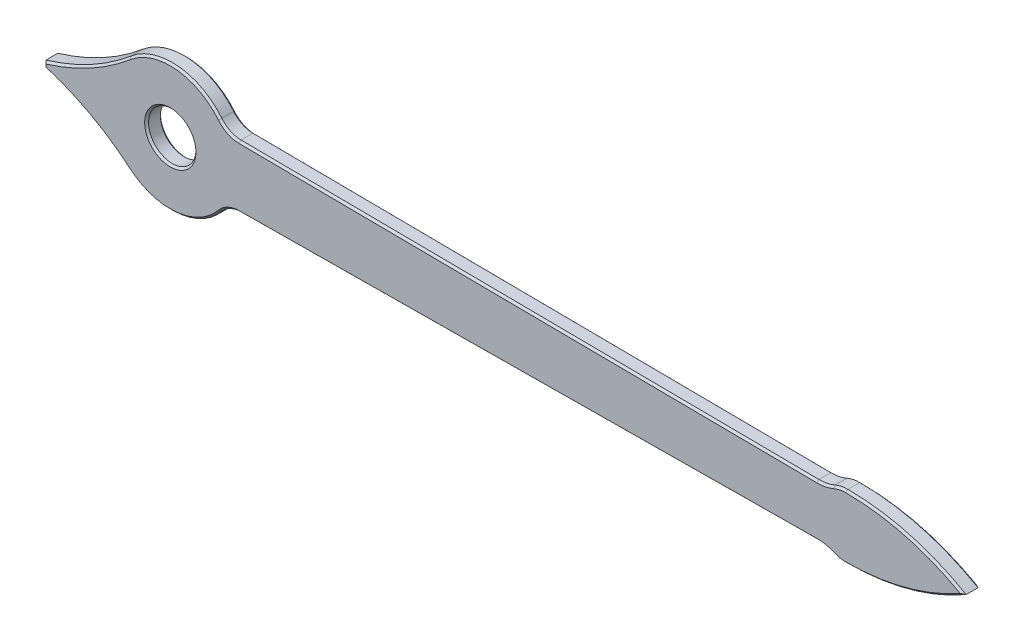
ISO-10303-21;
HEADER;
FILE_DESCRIPTION(('STEP AP214'),'2;1');
FILE_NAME('part.step','',(''),(''),'','','');
FILE_SCHEMA(('AUTOMOTIVE_DESIGN { 1 0 10303 214 1 1 1 1 }'));
ENDSEC;
DATA;
#1=APPLICATION_CONTEXT('core data for automotive mechanical design processes');
#2=APPLICATION_PROTOCOL_DEFINITION('international standard','automotive_design',2000,#1);
#3=PRODUCT_CONTEXT('',#1,'mechanical');
#4=PRODUCT('Part','Part','',(#3));
#5=PRODUCT_RELATED_PRODUCT_CATEGORY('part','',(#4));
#6=PRODUCT_DEFINITION_FORMATION('','',#4);
#7=PRODUCT_DEFINITION_CONTEXT('part definition',#1,'design');
#8=PRODUCT_DEFINITION('design','',#6,#7);
#9=PRODUCT_DEFINITION_SHAPE('','',#8);
#10=(LENGTH_UNIT() NAMED_UNIT(*) SI_UNIT(.MILLI.,.METRE.));
#11=(NAMED_UNIT(*) PLANE_ANGLE_UNIT() SI_UNIT($,.RADIAN.));
#12=(NAMED_UNIT(*) SI_UNIT($,.STERADIAN.) SOLID_ANGLE_UNIT());
#13=UNCERTAINTY_MEASURE_WITH_UNIT(LENGTH_MEASURE(1.E-05),#10,'distance_accuracy_value','');
#14=(GEOMETRIC_REPRESENTATION_CONTEXT(3) GLOBAL_UNCERTAINTY_ASSIGNED_CONTEXT((#13)) GLOBAL_UNIT_ASSIGNED_CONTEXT((#10,
#11,#12)) REPRESENTATION_CONTEXT('',''));
#15=CARTESIAN_POINT('',(0.,0.,0.));
#16=DIRECTION('',(0.,0.,1.));
#17=DIRECTION('',(1.,0.,0.));
#18=AXIS2_PLACEMENT_3D('',#15,#16,#17);
#19=CARTESIAN_POINT('',(85.6,25.7527777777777,2.));
#20=DIRECTION('',(0.,0.,-1.));
#21=DIRECTION('',(-1.,0.,0.));
#22=AXIS2_PLACEMENT_3D('',#19,#20,#21);
#23=PLANE('',#22);
#24=CARTESIAN_POINT('',(0.,0.,2.));
#25=DIRECTION('',(0.,0.,-1.));
#26=DIRECTION('',(-1.,0.,0.));
#27=AXIS2_PLACEMENT_3D('',#24,#25,#26);
#28=CIRCLE('',#27,3.24999999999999);
#29=CARTESIAN_POINT('',(-3.24999999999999,0.,2.));
#30=VERTEX_POINT('',#29);
#31=EDGE_CURVE('E11',#30,#30,#28,.T.);
#32=ORIENTED_EDGE('',*,*,#31,.T.);
#33=EDGE_LOOP('',(#32));
#34=FACE_BOUND('',#33,.T.);
#35=CARTESIAN_POINT('',(81.9922776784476,-8.29980961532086,2.));
#36=DIRECTION('',(0.,0.,-1.));
#37=DIRECTION('',(-1.,0.,0.));
#38=AXIS2_PLACEMENT_3D('',#35,#36,#37);
#39=CIRCLE('',#38,5.25000000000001);
#40=CARTESIAN_POINT('',(81.9464633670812,-3.05000951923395,2.));
#41=VERTEX_POINT('',#40);
#42=CARTESIAN_POINT('',(84.0851552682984,-3.4850029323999,2.));
#43=VERTEX_POINT('',#42);
#44=EDGE_CURVE('E48',#41,#43,#39,.T.);
#45=ORIENTED_EDGE('',*,*,#44,.T.);
#46=CARTESIAN_POINT('',(85.6,0.,2.));
#47=DIRECTION('',(0.,0.,-1.));
#48=DIRECTION('',(-1.,0.,0.));
#49=AXIS2_PLACEMENT_3D('',#46,#47,#48);
#50=CIRCLE('',#49,3.79999999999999);
#51=CARTESIAN_POINT('',(85.6,-3.79999999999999,2.));
#52=VERTEX_POINT('',#51);
#53=EDGE_CURVE('E40',#43,#52,#50,.F.);
#54=ORIENTED_EDGE('',*,*,#53,.T.);
#55=CARTESIAN_POINT('',(85.6,25.7527777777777,2.));
#56=DIRECTION('',(0.,0.,-1.));
#57=DIRECTION('',(-1.,0.,0.));
#58=AXIS2_PLACEMENT_3D('',#55,#56,#57);
#59=CIRCLE('',#58,29.5527777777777);
#60=CARTESIAN_POINT('',(100.096934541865,0.,2.));
#61=VERTEX_POINT('',#60);
#62=EDGE_CURVE('E331',#52,#61,#59,.F.);
#63=ORIENTED_EDGE('',*,*,#62,.T.);
#64=CARTESIAN_POINT('',(85.6,-25.7527777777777,2.));
#65=DIRECTION('',(0.,0.,-1.));
#66=DIRECTION('',(-1.,0.,0.));
#67=AXIS2_PLACEMENT_3D('',#64,#65,#66);
#68=CIRCLE('',#67,29.5527777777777);
#69=CARTESIAN_POINT('',(85.6,3.79999999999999,2.));
#70=VERTEX_POINT('',#69);
#71=EDGE_CURVE('E333',#61,#70,#68,.F.);
#72=ORIENTED_EDGE('',*,*,#71,.T.);
#73=CARTESIAN_POINT('',(85.6,0.,2.));
#74=DIRECTION('',(0.,0.,-1.));
#75=DIRECTION('',(-1.,0.,0.));
#76=AXIS2_PLACEMENT_3D('',#73,#74,#75);
#77=CIRCLE('',#76,3.79999999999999);
#78=CARTESIAN_POINT('',(84.0851552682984,3.4850029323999,2.));
#79=VERTEX_POINT('',#78);
#80=EDGE_CURVE('E335',#70,#79,#77,.F.);
#81=ORIENTED_EDGE('',*,*,#80,.T.);
#82=CARTESIAN_POINT('',(81.9922776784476,8.29980961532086,2.));
#83=DIRECTION('',(0.,0.,-1.));
#84=DIRECTION('',(-1.,0.,0.));
#85=AXIS2_PLACEMENT_3D('',#82,#83,#84);
#86=CIRCLE('',#85,5.25000000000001);
#87=CARTESIAN_POINT('',(81.9464633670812,3.05000951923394,2.));
#88=VERTEX_POINT('',#87);
#89=EDGE_CURVE('E337',#79,#88,#86,.T.);
#90=ORIENTED_EDGE('',*,*,#89,.T.);
#91=DIRECTION('',(-0.999961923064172,0.00872653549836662,0.));
#92=VECTOR('',#91,1.);
#93=CARTESIAN_POINT('',(85.4016128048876,3.01985688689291,2.));
#94=LINE('',#93,#92);
#95=CARTESIAN_POINT('',(8.71754025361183,3.68906864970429,2.));
#96=VERTEX_POINT('',#95);
#97=EDGE_CURVE('E339',#88,#96,#94,.T.);
#98=ORIENTED_EDGE('',*,*,#97,.T.);
#99=CARTESIAN_POINT('',(8.74742863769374,7.11393823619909,2.));
#100=DIRECTION('',(0.,0.,-1.));
#101=DIRECTION('',(-1.,0.,0.));
#102=AXIS2_PLACEMENT_3D('',#99,#100,#101);
#103=CIRCLE('',#102,3.42500000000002);
#104=CARTESIAN_POINT('',(6.09022747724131,4.95294147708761,2.));
#105=VERTEX_POINT('',#104);
#106=EDGE_CURVE('E341',#96,#105,#103,.T.);
#107=ORIENTED_EDGE('',*,*,#106,.T.);
#108=CARTESIAN_POINT('',(0.,0.,2.));
#109=DIRECTION('',(0.,0.,-1.));
#110=DIRECTION('',(-1.,0.,0.));
#111=AXIS2_PLACEMENT_3D('',#108,#109,#110);
#112=CIRCLE('',#111,7.84999999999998);
#113=CARTESIAN_POINT('',(-5.06752410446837,5.99522305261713,2.));
#114=VERTEX_POINT('',#113);
#115=EDGE_CURVE('E343',#105,#114,#112,.F.);
#116=ORIENTED_EDGE('',*,*,#115,.T.);
#117=CARTESIAN_POINT('',(-24.5952443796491,29.0978341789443,2.));
#118=DIRECTION('',(0.,0.,-1.));
#119=DIRECTION('',(-1.,0.,0.));
#120=AXIS2_PLACEMENT_3D('',#117,#118,#119);
#121=CIRCLE('',#120,30.25);
#122=CARTESIAN_POINT('',(-15.75,0.1699211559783,2.));
#123=VERTEX_POINT('',#122);
#124=EDGE_CURVE('E345',#114,#123,#121,.T.);
#125=ORIENTED_EDGE('',*,*,#124,.T.);
#126=DIRECTION('',(0.,-1.,0.));
#127=VECTOR('',#126,1.);
#128=CARTESIAN_POINT('',(-15.75,25.7527777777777,2.));
#129=LINE('',#128,#127);
#130=CARTESIAN_POINT('',(-15.75,-0.1699211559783,2.));
#131=VERTEX_POINT('',#130);
#132=EDGE_CURVE('E347',#123,#131,#129,.T.);
#133=ORIENTED_EDGE('',*,*,#132,.T.);
#134=CARTESIAN_POINT('',(-24.5952443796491,-29.0978341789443,2.));
#135=DIRECTION('',(0.,0.,-1.));
#136=DIRECTION('',(-1.,0.,0.));
#137=AXIS2_PLACEMENT_3D('',#134,#135,#136);
#138=CIRCLE('',#137,30.25);
#139=CARTESIAN_POINT('',(-5.06752410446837,-5.99522305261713,2.));
#140=VERTEX_POINT('',#139);
#141=EDGE_CURVE('E349',#131,#140,#138,.T.);
#142=ORIENTED_EDGE('',*,*,#141,.T.);
#143=CARTESIAN_POINT('',(0.,0.,2.));
#144=DIRECTION('',(0.,0.,-1.));
#145=DIRECTION('',(-1.,0.,0.));
#146=AXIS2_PLACEMENT_3D('',#143,#144,#145);
#147=CIRCLE('',#146,7.84999999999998);
#148=CARTESIAN_POINT('',(6.0902274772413,-4.95294147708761,2.));
#149=VERTEX_POINT('',#148);
#150=EDGE_CURVE('E351',#140,#149,#147,.F.);
#151=ORIENTED_EDGE('',*,*,#150,.T.);
#152=CARTESIAN_POINT('',(8.74742863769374,-7.11393823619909,2.));
#153=DIRECTION('',(0.,0.,-1.));
#154=DIRECTION('',(-1.,0.,0.));
#155=AXIS2_PLACEMENT_3D('',#152,#153,#154);
#156=CIRCLE('',#155,3.42500000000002);
#157=CARTESIAN_POINT('',(8.71754025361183,-3.68906864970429,2.));
#158=VERTEX_POINT('',#157);
#159=EDGE_CURVE('E353',#149,#158,#156,.T.);
#160=ORIENTED_EDGE('',*,*,#159,.T.);
#161=DIRECTION('',(0.999961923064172,0.00872653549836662,0.));
#162=VECTOR('',#161,1.);
#163=CARTESIAN_POINT('',(85.8510607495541,-3.01593461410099,2.));
#164=LINE('',#163,#162);
#165=EDGE_CURVE('E53',#158,#41,#164,.T.);
#166=ORIENTED_EDGE('',*,*,#165,.T.);
#167=EDGE_LOOP('',(#45,#54,#63,#72,#81,#90,#98,#107,#116,#125,#133,#142,#151,#160,#166));
#168=FACE_BOUND('',#167,.T.);
#169=ADVANCED_FACE('F31',(#34,#168),#23,.F.);
#170=CARTESIAN_POINT('',(85.6,25.7527777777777,0.));
#171=DIRECTION('',(0.,0.,-1.));
#172=DIRECTION('',(-1.,0.,0.));
#173=AXIS2_PLACEMENT_3D('',#170,#171,#172);
#174=PLANE('',#173);
#175=CARTESIAN_POINT('',(0.,0.,0.));
#176=DIRECTION('',(0.,0.,-1.));
#177=DIRECTION('',(-1.,0.,0.));
#178=AXIS2_PLACEMENT_3D('',#175,#176,#177);
#179=CIRCLE('',#178,3.24999999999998);
#180=CARTESIAN_POINT('',(-3.24999999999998,0.,0.));
#181=VERTEX_POINT('',#180);
#182=EDGE_CURVE('E257',#181,#181,#179,.F.);
#183=ORIENTED_EDGE('',*,*,#182,.T.);
#184=EDGE_LOOP('',(#183));
#185=FACE_BOUND('',#184,.T.);
#186=CARTESIAN_POINT('',(85.6,0.,0.));
#187=DIRECTION('',(0.,0.,-1.));
#188=DIRECTION('',(-1.,0.,0.));
#189=AXIS2_PLACEMENT_3D('',#186,#187,#188);
#190=CIRCLE('',#189,3.8);
#191=CARTESIAN_POINT('',(84.0851552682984,3.48500293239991,0.));
#192=VERTEX_POINT('',#191);
#193=CARTESIAN_POINT('',(85.6,3.8,0.));
#194=VERTEX_POINT('',#193);
#195=EDGE_CURVE('E256',#192,#194,#190,.T.);
#196=ORIENTED_EDGE('',*,*,#195,.T.);
#197=CARTESIAN_POINT('',(85.6,-25.7527777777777,0.));
#198=DIRECTION('',(0.,0.,-1.));
#199=DIRECTION('',(-1.,0.,0.));
#200=AXIS2_PLACEMENT_3D('',#197,#198,#199);
#201=CIRCLE('',#200,29.5527777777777);
#202=CARTESIAN_POINT('',(100.096934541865,0.,0.));
#203=VERTEX_POINT('',#202);
#204=EDGE_CURVE('E235',#194,#203,#201,.T.);
#205=ORIENTED_EDGE('',*,*,#204,.T.);
#206=CARTESIAN_POINT('',(85.6,25.7527777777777,0.));
#207=DIRECTION('',(0.,0.,-1.));
#208=DIRECTION('',(-1.,0.,0.));
#209=AXIS2_PLACEMENT_3D('',#206,#207,#208);
#210=CIRCLE('',#209,29.5527777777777);
#211=CARTESIAN_POINT('',(85.6,-3.8,0.));
#212=VERTEX_POINT('',#211);
#213=EDGE_CURVE('E245',#203,#212,#210,.T.);
#214=ORIENTED_EDGE('',*,*,#213,.T.);
#215=CARTESIAN_POINT('',(85.6,0.,0.));
#216=DIRECTION('',(0.,0.,-1.));
#217=DIRECTION('',(-1.,0.,0.));
#218=AXIS2_PLACEMENT_3D('',#215,#216,#217);
#219=CIRCLE('',#218,3.8);
#220=CARTESIAN_POINT('',(84.0851552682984,-3.48500293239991,0.));
#221=VERTEX_POINT('',#220);
#222=EDGE_CURVE('E251',#212,#221,#219,.T.);
#223=ORIENTED_EDGE('',*,*,#222,.T.);
#224=CARTESIAN_POINT('',(81.9922776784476,-8.29980961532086,0.));
#225=DIRECTION('',(0.,0.,-1.));
#226=DIRECTION('',(-1.,0.,0.));
#227=AXIS2_PLACEMENT_3D('',#224,#225,#226);
#228=CIRCLE('',#227,5.25);
#229=CARTESIAN_POINT('',(81.9464633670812,-3.05000951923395,0.));
#230=VERTEX_POINT('',#229);
#231=EDGE_CURVE('E619',#221,#230,#228,.F.);
#232=ORIENTED_EDGE('',*,*,#231,.T.);
#233=DIRECTION('',(-0.999961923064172,-0.00872653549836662,0.));
#234=VECTOR('',#233,1.);
#235=CARTESIAN_POINT('',(8.71754025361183,-3.6890686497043,0.));
#236=LINE('',#235,#234);
#237=CARTESIAN_POINT('',(8.71754025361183,-3.6890686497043,0.));
#238=VERTEX_POINT('',#237);
#239=EDGE_CURVE('E621',#230,#238,#236,.T.);
#240=ORIENTED_EDGE('',*,*,#239,.T.);
#241=CARTESIAN_POINT('',(8.74742863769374,-7.11393823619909,0.));
#242=DIRECTION('',(0.,0.,-1.));
#243=DIRECTION('',(-1.,0.,0.));
#244=AXIS2_PLACEMENT_3D('',#241,#242,#243);
#245=CIRCLE('',#244,3.42500000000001);
#246=CARTESIAN_POINT('',(6.09022747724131,-4.95294147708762,0.));
#247=VERTEX_POINT('',#246);
#248=EDGE_CURVE('E623',#238,#247,#245,.F.);
#249=ORIENTED_EDGE('',*,*,#248,.T.);
#250=CARTESIAN_POINT('',(0.,0.,0.));
#251=DIRECTION('',(0.,0.,-1.));
#252=DIRECTION('',(-1.,0.,0.));
#253=AXIS2_PLACEMENT_3D('',#250,#251,#252);
#254=CIRCLE('',#253,7.84999999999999);
#255=CARTESIAN_POINT('',(-5.06752410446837,-5.99522305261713,0.));
#256=VERTEX_POINT('',#255);
#257=EDGE_CURVE('E625',#247,#256,#254,.T.);
#258=ORIENTED_EDGE('',*,*,#257,.T.);
#259=CARTESIAN_POINT('',(-24.5952443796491,-29.0978341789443,0.));
#260=DIRECTION('',(0.,0.,-1.));
#261=DIRECTION('',(-1.,0.,0.));
#262=AXIS2_PLACEMENT_3D('',#259,#260,#261);
#263=CIRCLE('',#262,30.25);
#264=CARTESIAN_POINT('',(-15.75,-0.169921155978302,0.));
#265=VERTEX_POINT('',#264);
#266=EDGE_CURVE('E627',#256,#265,#263,.F.);
#267=ORIENTED_EDGE('',*,*,#266,.T.);
#268=DIRECTION('',(0.,1.,0.));
#269=VECTOR('',#268,1.);
#270=CARTESIAN_POINT('',(-15.75,0.355499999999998,0.));
#271=LINE('',#270,#269);
#272=CARTESIAN_POINT('',(-15.75,0.169921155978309,0.));
#273=VERTEX_POINT('',#272);
#274=EDGE_CURVE('E629',#265,#273,#271,.T.);
#275=ORIENTED_EDGE('',*,*,#274,.T.);
#276=CARTESIAN_POINT('',(-24.5952443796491,29.0978341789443,0.));
#277=DIRECTION('',(0.,0.,-1.));
#278=DIRECTION('',(-1.,0.,0.));
#279=AXIS2_PLACEMENT_3D('',#276,#277,#278);
#280=CIRCLE('',#279,30.25);
#281=CARTESIAN_POINT('',(-5.06752410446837,5.99522305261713,0.));
#282=VERTEX_POINT('',#281);
#283=EDGE_CURVE('E631',#273,#282,#280,.F.);
#284=ORIENTED_EDGE('',*,*,#283,.T.);
#285=CARTESIAN_POINT('',(0.,0.,0.));
#286=DIRECTION('',(0.,0.,-1.));
#287=DIRECTION('',(-1.,0.,0.));
#288=AXIS2_PLACEMENT_3D('',#285,#286,#287);
#289=CIRCLE('',#288,7.84999999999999);
#290=CARTESIAN_POINT('',(6.09022747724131,4.95294147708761,0.));
#291=VERTEX_POINT('',#290);
#292=EDGE_CURVE('E633',#282,#291,#289,.T.);
#293=ORIENTED_EDGE('',*,*,#292,.T.);
#294=CARTESIAN_POINT('',(8.74742863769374,7.11393823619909,0.));
#295=DIRECTION('',(0.,0.,-1.));
#296=DIRECTION('',(-1.,0.,0.));
#297=AXIS2_PLACEMENT_3D('',#294,#295,#296);
#298=CIRCLE('',#297,3.42500000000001);
#299=CARTESIAN_POINT('',(8.71754025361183,3.6890686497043,0.));
#300=VERTEX_POINT('',#299);
#301=EDGE_CURVE('E635',#291,#300,#298,.F.);
#302=ORIENTED_EDGE('',*,*,#301,.T.);
#303=DIRECTION('',(0.999961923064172,-0.00872653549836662,0.));
#304=VECTOR('',#303,1.);
#305=CARTESIAN_POINT('',(81.9464633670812,3.05000951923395,0.));
#306=LINE('',#305,#304);
#307=CARTESIAN_POINT('',(81.9464633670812,3.05000951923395,0.));
#308=VERTEX_POINT('',#307);
#309=EDGE_CURVE('E637',#300,#308,#306,.T.);
#310=ORIENTED_EDGE('',*,*,#309,.T.);
#311=CARTESIAN_POINT('',(81.9922776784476,8.29980961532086,0.));
#312=DIRECTION('',(0.,0.,-1.));
#313=DIRECTION('',(-1.,0.,0.));
#314=AXIS2_PLACEMENT_3D('',#311,#312,#313);
#315=CIRCLE('',#314,5.25);
#316=EDGE_CURVE('E262',#308,#192,#315,.F.);
#317=ORIENTED_EDGE('',*,*,#316,.T.);
#318=EDGE_LOOP('',(#196,#205,#214,#223,#232,#240,#249,#258,#267,#275,#284,#293,#302,#310,#317));
#319=FACE_BOUND('',#318,.T.);
#320=ADVANCED_FACE('F254',(#185,#319),#174,.T.);
#321=CARTESIAN_POINT('',(85.6,25.7527777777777,2.));
#322=DIRECTION('',(0.,0.,-1.));
#323=DIRECTION('',(-1.,0.,0.));
#324=AXIS2_PLACEMENT_3D('',#321,#322,#323);
#325=CYLINDRICAL_SURFACE('',#324,29.8027777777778);
#326=DIRECTION('',(0.,0.,-1.));
#327=VECTOR('',#326,1.);
#328=CARTESIAN_POINT('',(85.6,-4.05,2.));
#329=LINE('',#328,#327);
#330=CARTESIAN_POINT('',(85.6,-4.05,1.74999999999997));
#331=VERTEX_POINT('',#330);
#332=CARTESIAN_POINT('',(85.6,-4.05,0.250000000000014));
#333=VERTEX_POINT('',#332);
#334=EDGE_CURVE('E433',#331,#333,#329,.T.);
#335=ORIENTED_EDGE('',*,*,#334,.T.);
#336=CARTESIAN_POINT('',(85.6,25.7527777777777,0.250000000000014));
#337=DIRECTION('',(0.,0.,-1.));
#338=DIRECTION('',(-1.,0.,0.));
#339=AXIS2_PLACEMENT_3D('',#336,#337,#338);
#340=CIRCLE('',#339,29.8027777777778);
#341=CARTESIAN_POINT('',(100.6,0.,0.250000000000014));
#342=VERTEX_POINT('',#341);
#343=EDGE_CURVE('E329',#333,#342,#340,.F.);
#344=ORIENTED_EDGE('',*,*,#343,.T.);
#345=DIRECTION('',(0.,0.,-1.));
#346=VECTOR('',#345,1.);
#347=CARTESIAN_POINT('',(100.6,0.,2.));
#348=LINE('',#347,#346);
#349=CARTESIAN_POINT('',(100.6,0.,1.74999999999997));
#350=VERTEX_POINT('',#349);
#351=EDGE_CURVE('E252',#350,#342,#348,.T.);
#352=ORIENTED_EDGE('',*,*,#351,.F.);
#353=CARTESIAN_POINT('',(85.6,25.7527777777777,1.74999999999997));
#354=DIRECTION('',(0.,0.,-1.));
#355=DIRECTION('',(-1.,0.,0.));
#356=AXIS2_PLACEMENT_3D('',#353,#354,#355);
#357=CIRCLE('',#356,29.8027777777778);
#358=EDGE_CURVE('E327',#350,#331,#357,.T.);
#359=ORIENTED_EDGE('',*,*,#358,.T.);
#360=EDGE_LOOP('',(#335,#344,#352,#359));
#361=FACE_BOUND('',#360,.T.);
#362=ADVANCED_FACE('F570',(#361),#325,.T.);
#363=CARTESIAN_POINT('',(85.6,-25.7527777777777,2.));
#364=DIRECTION('',(0.,0.,-1.));
#365=DIRECTION('',(-1.,0.,0.));
#366=AXIS2_PLACEMENT_3D('',#363,#364,#365);
#367=CYLINDRICAL_SURFACE('',#366,29.8027777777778);
#368=ORIENTED_EDGE('',*,*,#351,.T.);
#369=CARTESIAN_POINT('',(85.6,-25.7527777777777,0.250000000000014));
#370=DIRECTION('',(0.,0.,-1.));
#371=DIRECTION('',(-1.,0.,0.));
#372=AXIS2_PLACEMENT_3D('',#369,#370,#371);
#373=CIRCLE('',#372,29.8027777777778);
#374=CARTESIAN_POINT('',(85.6,4.05000000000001,0.250000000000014));
#375=VERTEX_POINT('',#374);
#376=EDGE_CURVE('E238',#342,#375,#373,.F.);
#377=ORIENTED_EDGE('',*,*,#376,.T.);
#378=DIRECTION('',(0.,0.,-1.));
#379=VECTOR('',#378,1.);
#380=CARTESIAN_POINT('',(85.6,4.05000000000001,2.));
#381=LINE('',#380,#379);
#382=CARTESIAN_POINT('',(85.6,4.05000000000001,1.74999999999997));
#383=VERTEX_POINT('',#382);
#384=EDGE_CURVE('E614',#383,#375,#381,.T.);
#385=ORIENTED_EDGE('',*,*,#384,.F.);
#386=CARTESIAN_POINT('',(85.6,-25.7527777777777,1.74999999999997));
#387=DIRECTION('',(0.,0.,-1.));
#388=DIRECTION('',(-1.,0.,0.));
#389=AXIS2_PLACEMENT_3D('',#386,#387,#388);
#390=CIRCLE('',#389,29.8027777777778);
#391=EDGE_CURVE('E271',#383,#350,#390,.T.);
#392=ORIENTED_EDGE('',*,*,#391,.T.);
#393=EDGE_LOOP('',(#368,#377,#385,#392));
#394=FACE_BOUND('',#393,.T.);
#395=ADVANCED_FACE('F650',(#394),#367,.T.);
#396=CARTESIAN_POINT('',(85.6,0.,2.));
#397=DIRECTION('',(0.,0.,-1.));
#398=DIRECTION('',(-1.,0.,0.));
#399=AXIS2_PLACEMENT_3D('',#396,#397,#398);
#400=CYLINDRICAL_SURFACE('',#399,4.05);
#401=ORIENTED_EDGE('',*,*,#384,.T.);
#402=CARTESIAN_POINT('',(85.6,0.,0.250000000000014));
#403=DIRECTION('',(0.,0.,-1.));
#404=DIRECTION('',(-1.,0.,0.));
#405=AXIS2_PLACEMENT_3D('',#402,#403,#404);
#406=CIRCLE('',#405,4.05);
#407=CARTESIAN_POINT('',(83.9854944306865,3.71427944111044,0.250000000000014));
#408=VERTEX_POINT('',#407);
#409=EDGE_CURVE('E276',#375,#408,#406,.F.);
#410=ORIENTED_EDGE('',*,*,#409,.T.);
#411=DIRECTION('',(0.,0.,-1.));
#412=VECTOR('',#411,1.);
#413=CARTESIAN_POINT('',(83.9854944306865,3.71427944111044,2.));
#414=LINE('',#413,#412);
#415=CARTESIAN_POINT('',(83.9854944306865,3.71427944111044,1.74999999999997));
#416=VERTEX_POINT('',#415);
#417=EDGE_CURVE('E611',#416,#408,#414,.T.);
#418=ORIENTED_EDGE('',*,*,#417,.F.);
#419=CARTESIAN_POINT('',(85.6,0.,1.74999999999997));
#420=DIRECTION('',(0.,0.,-1.));
#421=DIRECTION('',(-1.,0.,0.));
#422=AXIS2_PLACEMENT_3D('',#419,#420,#421);
#423=CIRCLE('',#422,4.05);
#424=EDGE_CURVE('E274',#416,#383,#423,.T.);
#425=ORIENTED_EDGE('',*,*,#424,.T.);
#426=EDGE_LOOP('',(#401,#410,#418,#425));
#427=FACE_BOUND('',#426,.T.);
#428=ADVANCED_FACE('F651',(#427),#400,.T.);
#429=CARTESIAN_POINT('',(81.9922776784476,8.29980961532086,2.));
#430=DIRECTION('',(0.,0.,-1.));
#431=DIRECTION('',(-1.,0.,0.));
#432=AXIS2_PLACEMENT_3D('',#429,#430,#431);
#433=CYLINDRICAL_SURFACE('',#432,5.);
#434=ORIENTED_EDGE('',*,*,#417,.T.);
#435=CARTESIAN_POINT('',(81.9922776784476,8.29980961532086,0.250000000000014));
#436=DIRECTION('',(0.,0.,-1.));
#437=DIRECTION('',(-1.,0.,0.));
#438=AXIS2_PLACEMENT_3D('',#435,#436,#437);
#439=CIRCLE('',#438,5.);
#440=CARTESIAN_POINT('',(81.9486450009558,3.3,0.250000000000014));
#441=VERTEX_POINT('',#440);
#442=EDGE_CURVE('E280',#408,#441,#439,.T.);
#443=ORIENTED_EDGE('',*,*,#442,.T.);
#444=DIRECTION('',(0.,0.,-1.));
#445=VECTOR('',#444,1.);
#446=CARTESIAN_POINT('',(81.9486450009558,3.3,2.));
#447=LINE('',#446,#445);
#448=CARTESIAN_POINT('',(81.9486450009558,3.3,1.74999999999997));
#449=VERTEX_POINT('',#448);
#450=EDGE_CURVE('E608',#449,#441,#447,.T.);
#451=ORIENTED_EDGE('',*,*,#450,.F.);
#452=CARTESIAN_POINT('',(81.9922776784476,8.29980961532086,1.74999999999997));
#453=DIRECTION('',(0.,0.,-1.));
#454=DIRECTION('',(-1.,0.,0.));
#455=AXIS2_PLACEMENT_3D('',#452,#453,#454);
#456=CIRCLE('',#455,5.);
#457=EDGE_CURVE('E278',#449,#416,#456,.F.);
#458=ORIENTED_EDGE('',*,*,#457,.T.);
#459=EDGE_LOOP('',(#434,#443,#451,#458));
#460=FACE_BOUND('',#459,.T.);
#461=ADVANCED_FACE('F670',(#460),#433,.F.);
#462=CARTESIAN_POINT('',(81.9486450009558,3.3,2.));
#463=DIRECTION('',(-0.00872653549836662,-0.999961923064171,0.));
#464=DIRECTION('',(0.999961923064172,-0.00872653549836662,0.));
#465=AXIS2_PLACEMENT_3D('',#462,#463,#464);
#466=PLANE('',#465);
#467=ORIENTED_EDGE('',*,*,#450,.T.);
#468=DIRECTION('',(-0.999961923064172,0.00872653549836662,0.));
#469=VECTOR('',#468,1.);
#470=CARTESIAN_POINT('',(8.71972188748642,3.93905913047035,0.250000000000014));
#471=LINE('',#470,#469);
#472=CARTESIAN_POINT('',(8.71972188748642,3.93905913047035,0.250000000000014));
#473=VERTEX_POINT('',#472);
#474=EDGE_CURVE('E284',#441,#473,#471,.T.);
#475=ORIENTED_EDGE('',*,*,#474,.T.);
#476=DIRECTION('',(0.,0.,-1.));
#477=VECTOR('',#476,1.);
#478=CARTESIAN_POINT('',(8.71972188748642,3.93905913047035,2.));
#479=LINE('',#478,#477);
#480=CARTESIAN_POINT('',(8.71972188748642,3.93905913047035,1.74999999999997));
#481=VERTEX_POINT('',#480);
#482=EDGE_CURVE('E605',#481,#473,#479,.T.);
#483=ORIENTED_EDGE('',*,*,#482,.F.);
#484=DIRECTION('',(0.999961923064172,-0.00872653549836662,0.));
#485=VECTOR('',#484,1.);
#486=CARTESIAN_POINT('',(81.9486450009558,3.3,1.74999999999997));
#487=LINE('',#486,#485);
#488=EDGE_CURVE('E282',#481,#449,#487,.T.);
#489=ORIENTED_EDGE('',*,*,#488,.T.);
#490=EDGE_LOOP('',(#467,#475,#483,#489));
#491=FACE_BOUND('',#490,.T.);
#492=ADVANCED_FACE('F667',(#491),#466,.F.);
#493=CARTESIAN_POINT('',(8.74742863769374,7.11393823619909,2.));
#494=DIRECTION('',(0.,0.,-1.));
#495=DIRECTION('',(-1.,0.,0.));
#496=AXIS2_PLACEMENT_3D('',#493,#494,#495);
#497=CYLINDRICAL_SURFACE('',#496,3.175);
#498=ORIENTED_EDGE('',*,*,#482,.T.);
#499=CARTESIAN_POINT('',(8.74742863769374,7.11393823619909,0.250000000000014));
#500=DIRECTION('',(0.,0.,-1.));
#501=DIRECTION('',(-1.,0.,0.));
#502=AXIS2_PLACEMENT_3D('',#499,#500,#501);
#503=CIRCLE('',#502,3.175);
#504=CARTESIAN_POINT('',(6.28418376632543,5.11067846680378,0.250000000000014));
#505=VERTEX_POINT('',#504);
#506=EDGE_CURVE('E288',#473,#505,#503,.T.);
#507=ORIENTED_EDGE('',*,*,#506,.T.);
#508=DIRECTION('',(0.,0.,-1.));
#509=VECTOR('',#508,1.);
#510=CARTESIAN_POINT('',(6.28418376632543,5.11067846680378,2.));
#511=LINE('',#510,#509);
#512=CARTESIAN_POINT('',(6.28418376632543,5.11067846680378,1.74999999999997));
#513=VERTEX_POINT('',#512);
#514=EDGE_CURVE('E602',#513,#505,#511,.T.);
#515=ORIENTED_EDGE('',*,*,#514,.F.);
#516=CARTESIAN_POINT('',(8.74742863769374,7.11393823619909,1.74999999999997));
#517=DIRECTION('',(0.,0.,-1.));
#518=DIRECTION('',(-1.,0.,0.));
#519=AXIS2_PLACEMENT_3D('',#516,#517,#518);
#520=CIRCLE('',#519,3.175);
#521=EDGE_CURVE('E286',#513,#481,#520,.F.);
#522=ORIENTED_EDGE('',*,*,#521,.T.);
#523=EDGE_LOOP('',(#498,#507,#515,#522));
#524=FACE_BOUND('',#523,.T.);
#525=ADVANCED_FACE('F677',(#524),#497,.F.);
#526=CARTESIAN_POINT('',(0.,0.,2.));
#527=DIRECTION('',(0.,0.,-1.));
#528=DIRECTION('',(-1.,0.,0.));
#529=AXIS2_PLACEMENT_3D('',#526,#527,#528);
#530=CYLINDRICAL_SURFACE('',#529,8.1);
#531=ORIENTED_EDGE('',*,*,#514,.T.);
#532=CARTESIAN_POINT('',(0.,0.,0.250000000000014));
#533=DIRECTION('',(0.,0.,-1.));
#534=DIRECTION('',(-1.,0.,0.));
#535=AXIS2_PLACEMENT_3D('',#532,#533,#534);
#536=CIRCLE('',#535,8.1);
#537=CARTESIAN_POINT('',(-5.22891022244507,6.18615372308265,0.250000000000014));
#538=VERTEX_POINT('',#537);
#539=EDGE_CURVE('E292',#505,#538,#536,.F.);
#540=ORIENTED_EDGE('',*,*,#539,.T.);
#541=DIRECTION('',(0.,0.,-1.));
#542=VECTOR('',#541,1.);
#543=CARTESIAN_POINT('',(-5.22891022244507,6.18615372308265,2.));
#544=LINE('',#543,#542);
#545=CARTESIAN_POINT('',(-5.22891022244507,6.18615372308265,1.74999999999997));
#546=VERTEX_POINT('',#545);
#547=EDGE_CURVE('E599',#546,#538,#544,.T.);
#548=ORIENTED_EDGE('',*,*,#547,.F.);
#549=CARTESIAN_POINT('',(0.,0.,1.74999999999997));
#550=DIRECTION('',(0.,0.,-1.));
#551=DIRECTION('',(-1.,0.,0.));
#552=AXIS2_PLACEMENT_3D('',#549,#550,#551);
#553=CIRCLE('',#552,8.1);
#554=EDGE_CURVE('E290',#546,#513,#553,.T.);
#555=ORIENTED_EDGE('',*,*,#554,.T.);
#556=EDGE_LOOP('',(#531,#540,#548,#555));
#557=FACE_BOUND('',#556,.T.);
#558=ADVANCED_FACE('F720',(#557),#530,.T.);
#559=CARTESIAN_POINT('',(-24.5952443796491,29.0978341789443,2.));
#560=DIRECTION('',(0.,0.,-1.));
#561=DIRECTION('',(-1.,0.,0.));
#562=AXIS2_PLACEMENT_3D('',#559,#560,#561);
#563=CYLINDRICAL_SURFACE('',#562,30.);
#564=ORIENTED_EDGE('',*,*,#547,.T.);
#565=CARTESIAN_POINT('',(-24.5952443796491,29.0978341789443,0.250000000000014));
#566=DIRECTION('',(0.,0.,-1.));
#567=DIRECTION('',(-1.,0.,0.));
#568=AXIS2_PLACEMENT_3D('',#565,#566,#567);
#569=CIRCLE('',#568,30.);
#570=CARTESIAN_POINT('',(-16.,0.355499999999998,0.250000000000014));
#571=VERTEX_POINT('',#570);
#572=EDGE_CURVE('E296',#538,#571,#569,.T.);
#573=ORIENTED_EDGE('',*,*,#572,.T.);
#574=DIRECTION('',(0.,0.,-1.));
#575=VECTOR('',#574,1.);
#576=CARTESIAN_POINT('',(-16.,0.355499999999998,2.));
#577=LINE('',#576,#575);
#578=CARTESIAN_POINT('',(-16.,0.355499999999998,1.74999999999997));
#579=VERTEX_POINT('',#578);
#580=EDGE_CURVE('E596',#579,#571,#577,.T.);
#581=ORIENTED_EDGE('',*,*,#580,.F.);
#582=CARTESIAN_POINT('',(-24.5952443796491,29.0978341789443,1.74999999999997));
#583=DIRECTION('',(0.,0.,-1.));
#584=DIRECTION('',(-1.,0.,0.));
#585=AXIS2_PLACEMENT_3D('',#582,#583,#584);
#586=CIRCLE('',#585,30.);
#587=EDGE_CURVE('E294',#579,#546,#586,.F.);
#588=ORIENTED_EDGE('',*,*,#587,.T.);
#589=EDGE_LOOP('',(#564,#573,#581,#588));
#590=FACE_BOUND('',#589,.T.);
#591=ADVANCED_FACE('F716',(#590),#563,.F.);
#592=CARTESIAN_POINT('',(-16.,0.3555,2.));
#593=DIRECTION('',(1.,0.,0.));
#594=DIRECTION('',(0.,0.,-1.));
#595=AXIS2_PLACEMENT_3D('',#592,#593,#594);
#596=PLANE('',#595);
#597=ORIENTED_EDGE('',*,*,#580,.T.);
#598=DIRECTION('',(0.,-1.,0.));
#599=VECTOR('',#598,1.);
#600=CARTESIAN_POINT('',(-16.,-0.3555,0.250000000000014));
#601=LINE('',#600,#599);
#602=CARTESIAN_POINT('',(-16.,-0.3555,0.250000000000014));
#603=VERTEX_POINT('',#602);
#604=EDGE_CURVE('E300',#571,#603,#601,.T.);
#605=ORIENTED_EDGE('',*,*,#604,.T.);
#606=DIRECTION('',(0.,0.,-1.));
#607=VECTOR('',#606,1.);
#608=CARTESIAN_POINT('',(-16.,-0.3555,2.));
#609=LINE('',#608,#607);
#610=CARTESIAN_POINT('',(-16.,-0.3555,1.74999999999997));
#611=VERTEX_POINT('',#610);
#612=EDGE_CURVE('E593',#611,#603,#609,.T.);
#613=ORIENTED_EDGE('',*,*,#612,.F.);
#614=DIRECTION('',(0.,1.,0.));
#615=VECTOR('',#614,1.);
#616=CARTESIAN_POINT('',(-16.,0.3555,1.74999999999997));
#617=LINE('',#616,#615);
#618=EDGE_CURVE('E298',#611,#579,#617,.T.);
#619=ORIENTED_EDGE('',*,*,#618,.T.);
#620=EDGE_LOOP('',(#597,#605,#613,#619));
#621=FACE_BOUND('',#620,.T.);
#622=ADVANCED_FACE('F712',(#621),#596,.F.);
#623=CARTESIAN_POINT('',(-24.5952443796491,-29.0978341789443,2.));
#624=DIRECTION('',(0.,0.,-1.));
#625=DIRECTION('',(-1.,0.,0.));
#626=AXIS2_PLACEMENT_3D('',#623,#624,#625);
#627=CYLINDRICAL_SURFACE('',#626,30.);
#628=ORIENTED_EDGE('',*,*,#612,.T.);
#629=CARTESIAN_POINT('',(-24.5952443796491,-29.0978341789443,0.250000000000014));
#630=DIRECTION('',(0.,0.,-1.));
#631=DIRECTION('',(-1.,0.,0.));
#632=AXIS2_PLACEMENT_3D('',#629,#630,#631);
#633=CIRCLE('',#632,30.);
#634=CARTESIAN_POINT('',(-5.22891022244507,-6.18615372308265,0.250000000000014));
#635=VERTEX_POINT('',#634);
#636=EDGE_CURVE('E304',#603,#635,#633,.T.);
#637=ORIENTED_EDGE('',*,*,#636,.T.);
#638=DIRECTION('',(0.,0.,-1.));
#639=VECTOR('',#638,1.);
#640=CARTESIAN_POINT('',(-5.22891022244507,-6.18615372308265,2.));
#641=LINE('',#640,#639);
#642=CARTESIAN_POINT('',(-5.22891022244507,-6.18615372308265,1.74999999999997));
#643=VERTEX_POINT('',#642);
#644=EDGE_CURVE('E590',#643,#635,#641,.T.);
#645=ORIENTED_EDGE('',*,*,#644,.F.);
#646=CARTESIAN_POINT('',(-24.5952443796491,-29.0978341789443,1.74999999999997));
#647=DIRECTION('',(0.,0.,-1.));
#648=DIRECTION('',(-1.,0.,0.));
#649=AXIS2_PLACEMENT_3D('',#646,#647,#648);
#650=CIRCLE('',#649,30.);
#651=EDGE_CURVE('E302',#643,#611,#650,.F.);
#652=ORIENTED_EDGE('',*,*,#651,.T.);
#653=EDGE_LOOP('',(#628,#637,#645,#652));
#654=FACE_BOUND('',#653,.T.);
#655=ADVANCED_FACE('F708',(#654),#627,.F.);
#656=CARTESIAN_POINT('',(0.,0.,2.));
#657=DIRECTION('',(0.,0.,-1.));
#658=DIRECTION('',(-1.,0.,0.));
#659=AXIS2_PLACEMENT_3D('',#656,#657,#658);
#660=CYLINDRICAL_SURFACE('',#659,8.1);
#661=ORIENTED_EDGE('',*,*,#644,.T.);
#662=CARTESIAN_POINT('',(0.,0.,0.250000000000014));
#663=DIRECTION('',(0.,0.,-1.));
#664=DIRECTION('',(-1.,0.,0.));
#665=AXIS2_PLACEMENT_3D('',#662,#663,#664);
#666=CIRCLE('',#665,8.1);
#667=CARTESIAN_POINT('',(6.28418376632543,-5.11067846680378,0.250000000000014));
#668=VERTEX_POINT('',#667);
#669=EDGE_CURVE('E308',#635,#668,#666,.F.);
#670=ORIENTED_EDGE('',*,*,#669,.T.);
#671=DIRECTION('',(0.,0.,-1.));
#672=VECTOR('',#671,1.);
#673=CARTESIAN_POINT('',(6.28418376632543,-5.11067846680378,2.));
#674=LINE('',#673,#672);
#675=CARTESIAN_POINT('',(6.28418376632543,-5.11067846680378,1.74999999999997));
#676=VERTEX_POINT('',#675);
#677=EDGE_CURVE('E587',#676,#668,#674,.T.);
#678=ORIENTED_EDGE('',*,*,#677,.F.);
#679=CARTESIAN_POINT('',(0.,0.,1.74999999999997));
#680=DIRECTION('',(0.,0.,-1.));
#681=DIRECTION('',(-1.,0.,0.));
#682=AXIS2_PLACEMENT_3D('',#679,#680,#681);
#683=CIRCLE('',#682,8.1);
#684=EDGE_CURVE('E306',#676,#643,#683,.T.);
#685=ORIENTED_EDGE('',*,*,#684,.T.);
#686=EDGE_LOOP('',(#661,#670,#678,#685));
#687=FACE_BOUND('',#686,.T.);
#688=ADVANCED_FACE('F704',(#687),#660,.T.);
#689=CARTESIAN_POINT('',(8.74742863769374,-7.11393823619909,2.));
#690=DIRECTION('',(0.,0.,-1.));
#691=DIRECTION('',(-1.,0.,0.));
#692=AXIS2_PLACEMENT_3D('',#689,#690,#691);
#693=CYLINDRICAL_SURFACE('',#692,3.175);
#694=ORIENTED_EDGE('',*,*,#677,.T.);
#695=CARTESIAN_POINT('',(8.74742863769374,-7.11393823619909,0.250000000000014));
#696=DIRECTION('',(0.,0.,-1.));
#697=DIRECTION('',(-1.,0.,0.));
#698=AXIS2_PLACEMENT_3D('',#695,#696,#697);
#699=CIRCLE('',#698,3.175);
#700=CARTESIAN_POINT('',(8.71972188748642,-3.93905913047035,0.250000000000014));
#701=VERTEX_POINT('',#700);
#702=EDGE_CURVE('E312',#668,#701,#699,.T.);
#703=ORIENTED_EDGE('',*,*,#702,.T.);
#704=DIRECTION('',(0.,0.,-1.));
#705=VECTOR('',#704,1.);
#706=CARTESIAN_POINT('',(8.71972188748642,-3.93905913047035,2.));
#707=LINE('',#706,#705);
#708=CARTESIAN_POINT('',(8.71972188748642,-3.93905913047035,1.74999999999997));
#709=VERTEX_POINT('',#708);
#710=EDGE_CURVE('E584',#709,#701,#707,.T.);
#711=ORIENTED_EDGE('',*,*,#710,.F.);
#712=CARTESIAN_POINT('',(8.74742863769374,-7.11393823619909,1.74999999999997));
#713=DIRECTION('',(0.,0.,-1.));
#714=DIRECTION('',(-1.,0.,0.));
#715=AXIS2_PLACEMENT_3D('',#712,#713,#714);
#716=CIRCLE('',#715,3.175);
#717=EDGE_CURVE('E310',#709,#676,#716,.F.);
#718=ORIENTED_EDGE('',*,*,#717,.T.);
#719=EDGE_LOOP('',(#694,#703,#711,#718));
#720=FACE_BOUND('',#719,.T.);
#721=ADVANCED_FACE('F700',(#720),#693,.F.);
#722=CARTESIAN_POINT('',(81.9486450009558,-3.3,2.));
#723=DIRECTION('',(-0.00872653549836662,0.999961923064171,0.));
#724=DIRECTION('',(-0.999961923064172,-0.00872653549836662,0.));
#725=AXIS2_PLACEMENT_3D('',#722,#723,#724);
#726=PLANE('',#725);
#727=ORIENTED_EDGE('',*,*,#710,.T.);
#728=DIRECTION('',(0.999961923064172,0.00872653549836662,0.));
#729=VECTOR('',#728,1.);
#730=CARTESIAN_POINT('',(81.9486450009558,-3.3,0.250000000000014));
#731=LINE('',#730,#729);
#732=CARTESIAN_POINT('',(81.9486450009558,-3.3,0.250000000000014));
#733=VERTEX_POINT('',#732);
#734=EDGE_CURVE('E316',#701,#733,#731,.T.);
#735=ORIENTED_EDGE('',*,*,#734,.T.);
#736=DIRECTION('',(0.,0.,-1.));
#737=VECTOR('',#736,1.);
#738=CARTESIAN_POINT('',(81.9486450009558,-3.3,2.));
#739=LINE('',#738,#737);
#740=CARTESIAN_POINT('',(81.9486450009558,-3.3,1.74999999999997));
#741=VERTEX_POINT('',#740);
#742=EDGE_CURVE('E579',#741,#733,#739,.T.);
#743=ORIENTED_EDGE('',*,*,#742,.F.);
#744=DIRECTION('',(-0.999961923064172,-0.00872653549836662,0.));
#745=VECTOR('',#744,1.);
#746=CARTESIAN_POINT('',(81.9486450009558,-3.3,1.74999999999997));
#747=LINE('',#746,#745);
#748=EDGE_CURVE('E314',#741,#709,#747,.T.);
#749=ORIENTED_EDGE('',*,*,#748,.T.);
#750=EDGE_LOOP('',(#727,#735,#743,#749));
#751=FACE_BOUND('',#750,.T.);
#752=ADVANCED_FACE('F696',(#751),#726,.F.);
#753=CARTESIAN_POINT('',(81.9922776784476,-8.29980961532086,2.));
#754=DIRECTION('',(0.,0.,-1.));
#755=DIRECTION('',(-1.,0.,0.));
#756=AXIS2_PLACEMENT_3D('',#753,#754,#755);
#757=CYLINDRICAL_SURFACE('',#756,5.);
#758=ORIENTED_EDGE('',*,*,#742,.T.);
#759=CARTESIAN_POINT('',(81.9922776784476,-8.29980961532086,0.250000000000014));
#760=DIRECTION('',(0.,0.,-1.));
#761=DIRECTION('',(-1.,0.,0.));
#762=AXIS2_PLACEMENT_3D('',#759,#760,#761);
#763=CIRCLE('',#762,5.);
#764=CARTESIAN_POINT('',(83.9854944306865,-3.71427944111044,0.250000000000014));
#765=VERTEX_POINT('',#764);
#766=EDGE_CURVE('E320',#733,#765,#763,.T.);
#767=ORIENTED_EDGE('',*,*,#766,.T.);
#768=DIRECTION('',(0.,0.,-1.));
#769=VECTOR('',#768,1.);
#770=CARTESIAN_POINT('',(83.9854944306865,-3.71427944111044,2.));
#771=LINE('',#770,#769);
#772=CARTESIAN_POINT('',(83.9854944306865,-3.71427944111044,1.74999999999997));
#773=VERTEX_POINT('',#772);
#774=EDGE_CURVE('E577',#773,#765,#771,.T.);
#775=ORIENTED_EDGE('',*,*,#774,.F.);
#776=CARTESIAN_POINT('',(81.9922776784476,-8.29980961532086,1.74999999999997));
#777=DIRECTION('',(0.,0.,-1.));
#778=DIRECTION('',(-1.,0.,0.));
#779=AXIS2_PLACEMENT_3D('',#776,#777,#778);
#780=CIRCLE('',#779,5.);
#781=EDGE_CURVE('E318',#773,#741,#780,.F.);
#782=ORIENTED_EDGE('',*,*,#781,.T.);
#783=EDGE_LOOP('',(#758,#767,#775,#782));
#784=FACE_BOUND('',#783,.T.);
#785=ADVANCED_FACE('F693',(#784),#757,.F.);
#786=CARTESIAN_POINT('',(85.6,0.,2.));
#787=DIRECTION('',(0.,0.,-1.));
#788=DIRECTION('',(-1.,0.,0.));
#789=AXIS2_PLACEMENT_3D('',#786,#787,#788);
#790=CYLINDRICAL_SURFACE('',#789,4.05);
#791=ORIENTED_EDGE('',*,*,#774,.T.);
#792=CARTESIAN_POINT('',(85.6,0.,0.250000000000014));
#793=DIRECTION('',(0.,0.,-1.));
#794=DIRECTION('',(-1.,0.,0.));
#795=AXIS2_PLACEMENT_3D('',#792,#793,#794);
#796=CIRCLE('',#795,4.05);
#797=EDGE_CURVE('E325',#765,#333,#796,.F.);
#798=ORIENTED_EDGE('',*,*,#797,.T.);
#799=ORIENTED_EDGE('',*,*,#334,.F.);
#800=CARTESIAN_POINT('',(85.6,0.,1.74999999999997));
#801=DIRECTION('',(0.,0.,-1.));
#802=DIRECTION('',(-1.,0.,0.));
#803=AXIS2_PLACEMENT_3D('',#800,#801,#802);
#804=CIRCLE('',#803,4.05);
#805=EDGE_CURVE('E322',#331,#773,#804,.T.);
#806=ORIENTED_EDGE('',*,*,#805,.T.);
#807=EDGE_LOOP('',(#791,#798,#799,#806));
#808=FACE_BOUND('',#807,.T.);
#809=ADVANCED_FACE('F574',(#808),#790,.T.);
#810=CARTESIAN_POINT('',(0.,0.,2.));
#811=DIRECTION('',(0.,0.,-1.));
#812=DIRECTION('',(-1.,0.,0.));
#813=AXIS2_PLACEMENT_3D('',#810,#811,#812);
#814=CYLINDRICAL_SURFACE('',#813,3.);
#815=CARTESIAN_POINT('',(0.,0.,0.249999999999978));
#816=DIRECTION('',(0.,0.,-1.));
#817=DIRECTION('',(-1.,0.,0.));
#818=AXIS2_PLACEMENT_3D('',#815,#816,#817);
#819=CIRCLE('',#818,3.);
#820=CARTESIAN_POINT('',(-3.,0.,0.249999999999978));
#821=VERTEX_POINT('',#820);
#822=EDGE_CURVE('E268',#821,#821,#819,.T.);
#823=ORIENTED_EDGE('',*,*,#822,.T.);
#824=EDGE_LOOP('',(#823));
#825=FACE_BOUND('',#824,.T.);
#826=CARTESIAN_POINT('',(0.,0.,1.75));
#827=DIRECTION('',(0.,0.,-1.));
#828=DIRECTION('',(-1.,0.,0.));
#829=AXIS2_PLACEMENT_3D('',#826,#827,#828);
#830=CIRCLE('',#829,3.);
#831=CARTESIAN_POINT('',(-3.,0.,1.75));
#832=VERTEX_POINT('',#831);
#833=EDGE_CURVE('E260',#832,#832,#830,.F.);
#834=ORIENTED_EDGE('',*,*,#833,.T.);
#835=EDGE_LOOP('',(#834));
#836=FACE_BOUND('',#835,.T.);
#837=ADVANCED_FACE('F689',(#825,#836),#814,.F.);
#838=CARTESIAN_POINT('',(0.,0.,0.));
#839=DIRECTION('',(0.,0.,-1.));
#840=DIRECTION('',(-1.,0.,0.));
#841=AXIS2_PLACEMENT_3D('',#838,#839,#840);
#842=CONICAL_SURFACE('',#841,3.24999999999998,0.785398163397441);
#843=ORIENTED_EDGE('',*,*,#822,.F.);
#844=EDGE_LOOP('',(#843));
#845=FACE_BOUND('',#844,.T.);
#846=ORIENTED_EDGE('',*,*,#182,.F.);
#847=EDGE_LOOP('',(#846));
#848=FACE_BOUND('',#847,.T.);
#849=ADVANCED_FACE('F440',(#845,#848),#842,.F.);
#850=CARTESIAN_POINT('',(-24.5952443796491,-29.0978341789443,0.250000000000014));
#851=DIRECTION('',(0.,0.,-1.));
#852=DIRECTION('',(-1.,0.,0.));
#853=AXIS2_PLACEMENT_3D('',#850,#851,#852);
#854=CONICAL_SURFACE('',#853,30.,0.785398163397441);
#855=DIRECTION('',(0.456468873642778,0.540033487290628,-0.707106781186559));
#856=VECTOR('',#855,1.);
#857=CARTESIAN_POINT('',(-5.22891022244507,-6.18615372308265,0.250000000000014));
#858=LINE('',#857,#856);
#859=EDGE_CURVE('E434',#635,#256,#858,.T.);
#860=ORIENTED_EDGE('',*,*,#859,.F.);
#861=ORIENTED_EDGE('',*,*,#636,.F.);
#862=CARTESIAN_POINT('',(-16.,-0.3555,0.250000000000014));
#863=CARTESIAN_POINT('',(-15.9583622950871,-0.324492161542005,0.20836229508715));
#864=CARTESIAN_POINT('',(-15.9167101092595,-0.293523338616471,0.166710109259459));
#865=CARTESIAN_POINT('',(-15.833376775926,-0.231663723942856,0.083376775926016));
#866=CARTESIAN_POINT('',(-15.7916956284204,-0.20077293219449,0.0416956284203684));
#867=CARTESIAN_POINT('',(-15.75,-0.169921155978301,0.));
#868=B_SPLINE_CURVE_WITH_KNOTS('',3,(#862,#863,#864,#865,#866,#867),.UNSPECIFIED.,.F.,.F.,(4,2,
4),(0.,0.199649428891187,0.399298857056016),.UNSPECIFIED.);
#869=EDGE_CURVE('E426',#265,#603,#868,.F.);
#870=ORIENTED_EDGE('',*,*,#869,.F.);
#871=ORIENTED_EDGE('',*,*,#266,.F.);
#872=EDGE_LOOP('',(#860,#861,#870,#871));
#873=FACE_BOUND('',#872,.T.);
#874=ADVANCED_FACE('F413',(#873),#854,.F.);
#875=CARTESIAN_POINT('',(-16.,0.3555,0.250000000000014));
#876=DIRECTION('',(-0.707106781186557,0.,-0.707106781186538));
#877=DIRECTION('',(-0.707106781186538,0.,0.707106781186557));
#878=AXIS2_PLACEMENT_3D('',#875,#876,#877);
#879=PLANE('',#878);
#880=ORIENTED_EDGE('',*,*,#869,.T.);
#881=ORIENTED_EDGE('',*,*,#604,.F.);
#882=CARTESIAN_POINT('',(-16.,0.355499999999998,0.250000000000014));
#883=CARTESIAN_POINT('',(-15.9583622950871,0.324492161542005,0.208362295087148));
#884=CARTESIAN_POINT('',(-15.9167101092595,0.293523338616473,0.166710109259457));
#885=CARTESIAN_POINT('',(-15.833376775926,0.231663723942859,0.0833767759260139));
#886=CARTESIAN_POINT('',(-15.7916956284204,0.200772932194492,0.0416956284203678));
#887=CARTESIAN_POINT('',(-15.75,0.169921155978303,0.));
#888=B_SPLINE_CURVE_WITH_KNOTS('',3,(#882,#883,#884,#885,#886,#887),.UNSPECIFIED.,.F.,.F.,(4,2,
4),(0.,0.199649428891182,0.399298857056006),.UNSPECIFIED.);
#889=EDGE_CURVE('E419',#273,#571,#888,.F.);
#890=ORIENTED_EDGE('',*,*,#889,.F.);
#891=ORIENTED_EDGE('',*,*,#274,.F.);
#892=EDGE_LOOP('',(#880,#881,#890,#891));
#893=FACE_BOUND('',#892,.T.);
#894=ADVANCED_FACE('F408',(#893),#879,.T.);
#895=CARTESIAN_POINT('',(0.,0.,0.250000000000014));
#896=DIRECTION('',(0.,0.,1.));
#897=DIRECTION('',(1.,0.,0.));
#898=AXIS2_PLACEMENT_3D('',#895,#896,#897);
#899=CONICAL_SURFACE('',#898,8.1,0.785398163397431);
#900=ORIENTED_EDGE('',*,*,#859,.T.);
#901=ORIENTED_EDGE('',*,*,#257,.F.);
#902=DIRECTION('',(-0.548591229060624,0.446147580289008,-0.70710678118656));
#903=VECTOR('',#902,1.);
#904=CARTESIAN_POINT('',(6.28418376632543,-5.11067846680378,0.250000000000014));
#905=LINE('',#904,#903);
#906=EDGE_CURVE('E754',#668,#247,#905,.T.);
#907=ORIENTED_EDGE('',*,*,#906,.F.);
#908=ORIENTED_EDGE('',*,*,#669,.F.);
#909=EDGE_LOOP('',(#900,#901,#907,#908));
#910=FACE_BOUND('',#909,.T.);
#911=ADVANCED_FACE('F412',(#910),#899,.T.);
#912=CARTESIAN_POINT('',(-24.5952443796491,29.0978341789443,0.250000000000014));
#913=DIRECTION('',(0.,0.,-1.));
#914=DIRECTION('',(-1.,0.,0.));
#915=AXIS2_PLACEMENT_3D('',#912,#913,#914);
#916=CONICAL_SURFACE('',#915,30.,0.785398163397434);
#917=ORIENTED_EDGE('',*,*,#889,.T.);
#918=ORIENTED_EDGE('',*,*,#572,.F.);
#919=DIRECTION('',(-0.456468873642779,0.540033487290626,0.70710678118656));
#920=VECTOR('',#919,1.);
#921=CARTESIAN_POINT('',(-5.06752410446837,5.99522305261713,0.));
#922=LINE('',#921,#920);
#923=EDGE_CURVE('E752',#282,#538,#922,.T.);
#924=ORIENTED_EDGE('',*,*,#923,.F.);
#925=ORIENTED_EDGE('',*,*,#283,.F.);
#926=EDGE_LOOP('',(#917,#918,#924,#925));
#927=FACE_BOUND('',#926,.T.);
#928=ADVANCED_FACE('F406',(#927),#916,.F.);
#929=CARTESIAN_POINT('',(8.74742863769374,-7.11393823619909,0.250000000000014));
#930=DIRECTION('',(0.,0.,-1.));
#931=DIRECTION('',(-1.,0.,0.));
#932=AXIS2_PLACEMENT_3D('',#929,#930,#931);
#933=CONICAL_SURFACE('',#932,3.175,0.785398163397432);
#934=ORIENTED_EDGE('',*,*,#906,.T.);
#935=ORIENTED_EDGE('',*,*,#248,.F.);
#936=DIRECTION('',(-0.0061705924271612,0.707079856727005,-0.707106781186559));
#937=VECTOR('',#936,1.);
#938=CARTESIAN_POINT('',(8.71972188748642,-3.93905913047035,0.250000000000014));
#939=LINE('',#938,#937);
#940=EDGE_CURVE('E749',#701,#238,#939,.T.);
#941=ORIENTED_EDGE('',*,*,#940,.F.);
#942=ORIENTED_EDGE('',*,*,#702,.F.);
#943=EDGE_LOOP('',(#934,#935,#941,#942));
#944=FACE_BOUND('',#943,.T.);
#945=ADVANCED_FACE('F402',(#944),#933,.F.);
#946=CARTESIAN_POINT('',(0.,0.,0.250000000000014));
#947=DIRECTION('',(0.,0.,1.));
#948=DIRECTION('',(1.,0.,0.));
#949=AXIS2_PLACEMENT_3D('',#946,#947,#948);
#950=CONICAL_SURFACE('',#949,8.1,0.785398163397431);
#951=ORIENTED_EDGE('',*,*,#923,.T.);
#952=ORIENTED_EDGE('',*,*,#539,.F.);
#953=DIRECTION('',(0.548591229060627,0.446147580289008,0.707106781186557));
#954=VECTOR('',#953,1.);
#955=CARTESIAN_POINT('',(6.09022747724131,4.95294147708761,0.));
#956=LINE('',#955,#954);
#957=EDGE_CURVE('E737',#291,#505,#956,.T.);
#958=ORIENTED_EDGE('',*,*,#957,.F.);
#959=ORIENTED_EDGE('',*,*,#292,.F.);
#960=EDGE_LOOP('',(#951,#952,#958,#959));
#961=FACE_BOUND('',#960,.T.);
#962=ADVANCED_FACE('F398',(#961),#950,.T.);
#963=CARTESIAN_POINT('',(81.9486450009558,-3.3,0.250000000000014));
#964=DIRECTION('',(0.00617059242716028,-0.70707985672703,-0.707106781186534));
#965=DIRECTION('',(0.,0.707120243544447,-0.707093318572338));
#966=AXIS2_PLACEMENT_3D('',#963,#964,#965);
#967=PLANE('',#966);
#968=ORIENTED_EDGE('',*,*,#940,.T.);
#969=ORIENTED_EDGE('',*,*,#239,.F.);
#970=DIRECTION('',(-0.00617059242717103,0.707079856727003,-0.707106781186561));
#971=VECTOR('',#970,1.);
#972=CARTESIAN_POINT('',(81.9486450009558,-3.3,0.250000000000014));
#973=LINE('',#972,#971);
#974=EDGE_CURVE('E738',#733,#230,#973,.T.);
#975=ORIENTED_EDGE('',*,*,#974,.F.);
#976=ORIENTED_EDGE('',*,*,#734,.F.);
#977=EDGE_LOOP('',(#968,#969,#975,#976));
#978=FACE_BOUND('',#977,.T.);
#979=ADVANCED_FACE('F394',(#978),#967,.T.);
#980=CARTESIAN_POINT('',(8.74742863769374,7.11393823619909,0.250000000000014));
#981=DIRECTION('',(0.,0.,-1.));
#982=DIRECTION('',(-1.,0.,0.));
#983=AXIS2_PLACEMENT_3D('',#980,#981,#982);
#984=CONICAL_SURFACE('',#983,3.175,0.785398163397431);
#985=ORIENTED_EDGE('',*,*,#957,.T.);
#986=ORIENTED_EDGE('',*,*,#506,.F.);
#987=DIRECTION('',(0.00617059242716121,0.707079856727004,0.70710678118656));
#988=VECTOR('',#987,1.);
#989=CARTESIAN_POINT('',(8.71754025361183,3.6890686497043,0.));
#990=LINE('',#989,#988);
#991=EDGE_CURVE('E735',#300,#473,#990,.T.);
#992=ORIENTED_EDGE('',*,*,#991,.F.);
#993=ORIENTED_EDGE('',*,*,#301,.F.);
#994=EDGE_LOOP('',(#985,#986,#992,#993));
#995=FACE_BOUND('',#994,.T.);
#996=ADVANCED_FACE('F390',(#995),#984,.F.);
#997=CARTESIAN_POINT('',(81.9922776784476,-8.29980961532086,0.250000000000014));
#998=DIRECTION('',(0.,0.,-1.));
#999=DIRECTION('',(-1.,0.,0.));
#1000=AXIS2_PLACEMENT_3D('',#997,#998,#999);
#1001=CONICAL_SURFACE('',#1000,5.,0.785398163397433);
#1002=ORIENTED_EDGE('',*,*,#974,.T.);
#1003=ORIENTED_EDGE('',*,*,#231,.F.);
#1004=DIRECTION('',(0.281883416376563,0.648491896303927,-0.707106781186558));
#1005=VECTOR('',#1004,1.);
#1006=CARTESIAN_POINT('',(83.9854944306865,-3.71427944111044,0.250000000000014));
#1007=LINE('',#1006,#1005);
#1008=EDGE_CURVE('E739',#765,#221,#1007,.T.);
#1009=ORIENTED_EDGE('',*,*,#1008,.F.);
#1010=ORIENTED_EDGE('',*,*,#766,.F.);
#1011=EDGE_LOOP('',(#1002,#1003,#1009,#1010));
#1012=FACE_BOUND('',#1011,.T.);
#1013=ADVANCED_FACE('F386',(#1012),#1001,.F.);
#1014=CARTESIAN_POINT('',(81.9486450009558,3.3,0.250000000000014));
#1015=DIRECTION('',(0.00617059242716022,0.707079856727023,-0.707106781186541));
#1016=DIRECTION('',(0.,0.707120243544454,0.707093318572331));
#1017=AXIS2_PLACEMENT_3D('',#1014,#1015,#1016);
#1018=PLANE('',#1017);
#1019=ORIENTED_EDGE('',*,*,#991,.T.);
#1020=ORIENTED_EDGE('',*,*,#474,.F.);
#1021=DIRECTION('',(0.00617059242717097,0.707079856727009,0.707106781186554));
#1022=VECTOR('',#1021,1.);
#1023=CARTESIAN_POINT('',(81.9464633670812,3.05000951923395,0.));
#1024=LINE('',#1023,#1022);
#1025=EDGE_CURVE('E744',#308,#441,#1024,.T.);
#1026=ORIENTED_EDGE('',*,*,#1025,.F.);
#1027=ORIENTED_EDGE('',*,*,#309,.F.);
#1028=EDGE_LOOP('',(#1019,#1020,#1026,#1027));
#1029=FACE_BOUND('',#1028,.T.);
#1030=ADVANCED_FACE('F382',(#1029),#1018,.T.);
#1031=CARTESIAN_POINT('',(85.6,0.,0.250000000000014));
#1032=DIRECTION('',(0.,0.,1.));
#1033=DIRECTION('',(1.,0.,0.));
#1034=AXIS2_PLACEMENT_3D('',#1031,#1032,#1033);
#1035=CONICAL_SURFACE('',#1034,4.05,0.785398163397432);
#1036=ORIENTED_EDGE('',*,*,#1008,.T.);
#1037=ORIENTED_EDGE('',*,*,#222,.F.);
#1038=DIRECTION('',(0.,0.707106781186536,-0.707106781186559));
#1039=VECTOR('',#1038,1.);
#1040=CARTESIAN_POINT('',(85.6,-4.05,0.250000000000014));
#1041=LINE('',#1040,#1039);
#1042=EDGE_CURVE('E248',#333,#212,#1041,.T.);
#1043=ORIENTED_EDGE('',*,*,#1042,.F.);
#1044=ORIENTED_EDGE('',*,*,#797,.F.);
#1045=EDGE_LOOP('',(#1036,#1037,#1043,#1044));
#1046=FACE_BOUND('',#1045,.T.);
#1047=ADVANCED_FACE('F378',(#1046),#1035,.T.);
#1048=CARTESIAN_POINT('',(81.9922776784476,8.29980961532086,0.250000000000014));
#1049=DIRECTION('',(0.,0.,-1.));
#1050=DIRECTION('',(-1.,0.,0.));
#1051=AXIS2_PLACEMENT_3D('',#1048,#1049,#1050);
#1052=CONICAL_SURFACE('',#1051,5.,0.785398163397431);
#1053=ORIENTED_EDGE('',*,*,#1025,.T.);
#1054=ORIENTED_EDGE('',*,*,#442,.F.);
#1055=DIRECTION('',(-0.281883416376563,0.648491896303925,0.707106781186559));
#1056=VECTOR('',#1055,1.);
#1057=CARTESIAN_POINT('',(84.0851552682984,3.48500293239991,0.));
#1058=LINE('',#1057,#1056);
#1059=EDGE_CURVE('E241',#192,#408,#1058,.T.);
#1060=ORIENTED_EDGE('',*,*,#1059,.F.);
#1061=ORIENTED_EDGE('',*,*,#316,.F.);
#1062=EDGE_LOOP('',(#1053,#1054,#1060,#1061));
#1063=FACE_BOUND('',#1062,.T.);
#1064=ADVANCED_FACE('F375',(#1063),#1052,.F.);
#1065=CARTESIAN_POINT('',(85.6,25.7527777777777,0.250000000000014));
#1066=DIRECTION('',(0.,0.,1.));
#1067=DIRECTION('',(1.,0.,0.));
#1068=AXIS2_PLACEMENT_3D('',#1065,#1066,#1067);
#1069=CONICAL_SURFACE('',#1068,29.8027777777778,0.785398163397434);
#1070=ORIENTED_EDGE('',*,*,#1042,.T.);
#1071=ORIENTED_EDGE('',*,*,#213,.F.);
#1072=CARTESIAN_POINT('',(100.096934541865,0.,0.));
#1073=CARTESIAN_POINT('',(100.180992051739,0.,0.0412375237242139));
#1074=CARTESIAN_POINT('',(100.264942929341,0.,0.0826896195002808));
#1075=CARTESIAN_POINT('',(100.432631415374,0.,0.166022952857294));
#1076=CARTESIAN_POINT('',(100.516369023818,0.,0.207904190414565));
#1077=CARTESIAN_POINT('',(100.6,0.,0.250000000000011));
#1078=B_SPLINE_CURVE_WITH_KNOTS('',3,(#1072,#1073,#1074,#1075,#1076,#1077),.UNSPECIFIED.,.F.,
.F.,(4,2,4),(0.,0.280881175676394,0.561762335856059),.UNSPECIFIED.);
#1079=EDGE_CURVE('E231',#342,#203,#1078,.F.);
#1080=ORIENTED_EDGE('',*,*,#1079,.F.);
#1081=ORIENTED_EDGE('',*,*,#343,.F.);
#1082=EDGE_LOOP('',(#1070,#1071,#1080,#1081));
#1083=FACE_BOUND('',#1082,.T.);
#1084=ADVANCED_FACE('F246',(#1083),#1069,.T.);
#1085=CARTESIAN_POINT('',(85.6,0.,0.250000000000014));
#1086=DIRECTION('',(0.,0.,1.));
#1087=DIRECTION('',(1.,0.,0.));
#1088=AXIS2_PLACEMENT_3D('',#1085,#1086,#1087);
#1089=CONICAL_SURFACE('',#1088,4.05,0.785398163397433);
#1090=ORIENTED_EDGE('',*,*,#1059,.T.);
#1091=ORIENTED_EDGE('',*,*,#409,.F.);
#1092=DIRECTION('',(0.,0.707106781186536,0.707106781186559));
#1093=VECTOR('',#1092,1.);
#1094=CARTESIAN_POINT('',(85.6,3.8,0.));
#1095=LINE('',#1094,#1093);
#1096=EDGE_CURVE('E242',#194,#375,#1095,.T.);
#1097=ORIENTED_EDGE('',*,*,#1096,.F.);
#1098=ORIENTED_EDGE('',*,*,#195,.F.);
#1099=EDGE_LOOP('',(#1090,#1091,#1097,#1098));
#1100=FACE_BOUND('',#1099,.T.);
#1101=ADVANCED_FACE('F371',(#1100),#1089,.T.);
#1102=CARTESIAN_POINT('',(85.6,-25.7527777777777,0.250000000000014));
#1103=DIRECTION('',(0.,0.,1.));
#1104=DIRECTION('',(1.,0.,0.));
#1105=AXIS2_PLACEMENT_3D('',#1102,#1103,#1104);
#1106=CONICAL_SURFACE('',#1105,29.8027777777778,0.785398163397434);
#1107=ORIENTED_EDGE('',*,*,#1079,.T.);
#1108=ORIENTED_EDGE('',*,*,#204,.F.);
#1109=ORIENTED_EDGE('',*,*,#1096,.T.);
#1110=ORIENTED_EDGE('',*,*,#376,.F.);
#1111=EDGE_LOOP('',(#1107,#1108,#1109,#1110));
#1112=FACE_BOUND('',#1111,.T.);
#1113=ADVANCED_FACE('F233',(#1112),#1106,.T.);
#1114=CARTESIAN_POINT('',(0.,0.,1.75));
#1115=DIRECTION('',(0.,0.,1.));
#1116=DIRECTION('',(1.,0.,0.));
#1117=AXIS2_PLACEMENT_3D('',#1114,#1115,#1116);
#1118=CONICAL_SURFACE('',#1117,3.,0.785398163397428);
#1119=ORIENTED_EDGE('',*,*,#31,.F.);
#1120=EDGE_LOOP('',(#1119));
#1121=FACE_BOUND('',#1120,.T.);
#1122=ORIENTED_EDGE('',*,*,#833,.F.);
#1123=EDGE_LOOP('',(#1122));
#1124=FACE_BOUND('',#1123,.T.);
#1125=ADVANCED_FACE('F370',(#1121,#1124),#1118,.F.);
#1126=CARTESIAN_POINT('',(-24.5952443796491,29.0978341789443,2.));
#1127=DIRECTION('',(0.,0.,1.));
#1128=DIRECTION('',(1.,0.,0.));
#1129=AXIS2_PLACEMENT_3D('',#1126,#1127,#1128);
#1130=CONICAL_SURFACE('',#1129,30.25,0.785398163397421);
#1131=CARTESIAN_POINT('',(-16.,0.355499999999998,1.74999999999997));
#1132=CARTESIAN_POINT('',(-15.9583622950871,0.324492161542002,1.79163770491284));
#1133=CARTESIAN_POINT('',(-15.9167101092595,0.293523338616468,1.83328989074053));
#1134=CARTESIAN_POINT('',(-15.833376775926,0.231663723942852,1.91662322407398));
#1135=CARTESIAN_POINT('',(-15.7916956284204,0.200772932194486,1.95830437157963));
#1136=CARTESIAN_POINT('',(-15.75,0.169921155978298,2.));
#1137=B_SPLINE_CURVE_WITH_KNOTS('',3,(#1131,#1132,#1133,#1134,#1135,#1136),.UNSPECIFIED.,.F.,
.F.,(4,2,4),(0.,0.199649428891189,0.39929885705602),.UNSPECIFIED.);
#1138=EDGE_CURVE('E515',#123,#579,#1137,.F.);
#1139=ORIENTED_EDGE('',*,*,#1138,.F.);
#1140=ORIENTED_EDGE('',*,*,#124,.F.);
#1141=DIRECTION('',(0.456468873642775,-0.540033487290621,0.707106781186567));
#1142=VECTOR('',#1141,1.);
#1143=CARTESIAN_POINT('',(-5.22891022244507,6.18615372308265,1.74999999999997));
#1144=LINE('',#1143,#1142);
#1145=EDGE_CURVE('E35',#546,#114,#1144,.T.);
#1146=ORIENTED_EDGE('',*,*,#1145,.F.);
#1147=ORIENTED_EDGE('',*,*,#587,.F.);
#1148=EDGE_LOOP('',(#1139,#1140,#1146,#1147));
#1149=FACE_BOUND('',#1148,.T.);
#1150=ADVANCED_FACE('F444',(#1149),#1130,.F.);
#1151=CARTESIAN_POINT('',(0.,0.,2.));
#1152=DIRECTION('',(0.,0.,-1.));
#1153=DIRECTION('',(-1.,0.,0.));
#1154=AXIS2_PLACEMENT_3D('',#1151,#1152,#1153);
#1155=CONICAL_SURFACE('',#1154,7.84999999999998,0.785398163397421);
#1156=ORIENTED_EDGE('',*,*,#1145,.T.);
#1157=ORIENTED_EDGE('',*,*,#115,.F.);
#1158=DIRECTION('',(-0.548591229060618,-0.446147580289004,0.707106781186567));
#1159=VECTOR('',#1158,1.);
#1160=CARTESIAN_POINT('',(6.28418376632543,5.11067846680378,1.74999999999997));
#1161=LINE('',#1160,#1159);
#1162=EDGE_CURVE('E499',#513,#105,#1161,.T.);
#1163=ORIENTED_EDGE('',*,*,#1162,.F.);
#1164=ORIENTED_EDGE('',*,*,#554,.F.);
#1165=EDGE_LOOP('',(#1156,#1157,#1163,#1164));
#1166=FACE_BOUND('',#1165,.T.);
#1167=ADVANCED_FACE('F33',(#1166),#1155,.T.);
#1168=CARTESIAN_POINT('',(-15.75,25.7527777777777,2.));
#1169=DIRECTION('',(0.707106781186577,0.,-0.707106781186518));
#1170=DIRECTION('',(-0.707106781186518,0.,-0.707106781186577));
#1171=AXIS2_PLACEMENT_3D('',#1168,#1169,#1170);
#1172=PLANE('',#1171);
#1173=ORIENTED_EDGE('',*,*,#1138,.T.);
#1174=ORIENTED_EDGE('',*,*,#618,.F.);
#1175=CARTESIAN_POINT('',(-16.,-0.3555,1.74999999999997));
#1176=CARTESIAN_POINT('',(-15.9583622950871,-0.324492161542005,1.79163770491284));
#1177=CARTESIAN_POINT('',(-15.9167101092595,-0.293523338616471,1.83328989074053));
#1178=CARTESIAN_POINT('',(-15.833376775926,-0.231663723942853,1.91662322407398));
#1179=CARTESIAN_POINT('',(-15.7916956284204,-0.200772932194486,1.95830437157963));
#1180=CARTESIAN_POINT('',(-15.75,-0.169921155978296,2.));
#1181=B_SPLINE_CURVE_WITH_KNOTS('',3,(#1175,#1176,#1177,#1178,#1179,#1180),.UNSPECIFIED.,.F.,
.F.,(4,2,4),(0.,0.199649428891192,0.399298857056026),.UNSPECIFIED.);
#1182=EDGE_CURVE('E491',#131,#611,#1181,.F.);
#1183=ORIENTED_EDGE('',*,*,#1182,.F.);
#1184=ORIENTED_EDGE('',*,*,#132,.F.);
#1185=EDGE_LOOP('',(#1173,#1174,#1183,#1184));
#1186=FACE_BOUND('',#1185,.T.);
#1187=ADVANCED_FACE('F500',(#1186),#1172,.F.);
#1188=CARTESIAN_POINT('',(8.74742863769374,7.11393823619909,2.));
#1189=DIRECTION('',(0.,0.,1.));
#1190=DIRECTION('',(1.,0.,0.));
#1191=AXIS2_PLACEMENT_3D('',#1188,#1189,#1190);
#1192=CONICAL_SURFACE('',#1191,3.42500000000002,0.785398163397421);
#1193=ORIENTED_EDGE('',*,*,#1162,.T.);
#1194=ORIENTED_EDGE('',*,*,#106,.F.);
#1195=DIRECTION('',(-0.00617059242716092,-0.707079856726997,0.707106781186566));
#1196=VECTOR('',#1195,1.);
#1197=CARTESIAN_POINT('',(8.71972188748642,3.93905913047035,1.74999999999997));
#1198=LINE('',#1197,#1196);
#1199=EDGE_CURVE('E488',#481,#96,#1198,.T.);
#1200=ORIENTED_EDGE('',*,*,#1199,.F.);
#1201=ORIENTED_EDGE('',*,*,#521,.F.);
#1202=EDGE_LOOP('',(#1193,#1194,#1200,#1201));
#1203=FACE_BOUND('',#1202,.T.);
#1204=ADVANCED_FACE('F508',(#1203),#1192,.F.);
#1205=CARTESIAN_POINT('',(-24.5952443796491,-29.0978341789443,2.));
#1206=DIRECTION('',(0.,0.,1.));
#1207=DIRECTION('',(1.,0.,0.));
#1208=AXIS2_PLACEMENT_3D('',#1205,#1206,#1207);
#1209=CONICAL_SURFACE('',#1208,30.25,0.785398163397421);
#1210=ORIENTED_EDGE('',*,*,#1182,.T.);
#1211=ORIENTED_EDGE('',*,*,#651,.F.);
#1212=DIRECTION('',(-0.456468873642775,-0.540033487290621,-0.707106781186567));
#1213=VECTOR('',#1212,1.);
#1214=CARTESIAN_POINT('',(-5.06752410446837,-5.99522305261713,2.));
#1215=LINE('',#1214,#1213);
#1216=EDGE_CURVE('E485',#140,#643,#1215,.T.);
#1217=ORIENTED_EDGE('',*,*,#1216,.F.);
#1218=ORIENTED_EDGE('',*,*,#141,.F.);
#1219=EDGE_LOOP('',(#1210,#1211,#1217,#1218));
#1220=FACE_BOUND('',#1219,.T.);
#1221=ADVANCED_FACE('F503',(#1220),#1209,.F.);
#1222=CARTESIAN_POINT('',(85.4016128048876,3.01985688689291,2.));
#1223=DIRECTION('',(-0.00617059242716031,-0.707079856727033,-0.707106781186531));
#1224=DIRECTION('',(0.,0.707120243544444,-0.707093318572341));
#1225=AXIS2_PLACEMENT_3D('',#1222,#1223,#1224);
#1226=PLANE('',#1225);
#1227=ORIENTED_EDGE('',*,*,#1199,.T.);
#1228=ORIENTED_EDGE('',*,*,#97,.F.);
#1229=DIRECTION('',(-0.00617059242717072,-0.707079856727,0.707106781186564));
#1230=VECTOR('',#1229,1.);
#1231=CARTESIAN_POINT('',(81.9486450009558,3.3,1.74999999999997));
#1232=LINE('',#1231,#1230);
#1233=EDGE_CURVE('E482',#449,#88,#1232,.T.);
#1234=ORIENTED_EDGE('',*,*,#1233,.F.);
#1235=ORIENTED_EDGE('',*,*,#488,.F.);
#1236=EDGE_LOOP('',(#1227,#1228,#1234,#1235));
#1237=FACE_BOUND('',#1236,.T.);
#1238=ADVANCED_FACE('F507',(#1237),#1226,.F.);
#1239=CARTESIAN_POINT('',(0.,0.,2.));
#1240=DIRECTION('',(0.,0.,-1.));
#1241=DIRECTION('',(-1.,0.,0.));
#1242=AXIS2_PLACEMENT_3D('',#1239,#1240,#1241);
#1243=CONICAL_SURFACE('',#1242,7.84999999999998,0.785398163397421);
#1244=ORIENTED_EDGE('',*,*,#1216,.T.);
#1245=ORIENTED_EDGE('',*,*,#684,.F.);
#1246=DIRECTION('',(0.548591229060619,-0.446147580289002,-0.707106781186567));
#1247=VECTOR('',#1246,1.);
#1248=CARTESIAN_POINT('',(6.0902274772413,-4.95294147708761,2.));
#1249=LINE('',#1248,#1247);
#1250=EDGE_CURVE('E479',#149,#676,#1249,.T.);
#1251=ORIENTED_EDGE('',*,*,#1250,.F.);
#1252=ORIENTED_EDGE('',*,*,#150,.F.);
#1253=EDGE_LOOP('',(#1244,#1245,#1251,#1252));
#1254=FACE_BOUND('',#1253,.T.);
#1255=ADVANCED_FACE('F544',(#1254),#1243,.T.);
#1256=CARTESIAN_POINT('',(81.9922776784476,8.29980961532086,2.));
#1257=DIRECTION('',(0.,0.,1.));
#1258=DIRECTION('',(1.,0.,0.));
#1259=AXIS2_PLACEMENT_3D('',#1256,#1257,#1258);
#1260=CONICAL_SURFACE('',#1259,5.25000000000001,0.785398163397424);
#1261=ORIENTED_EDGE('',*,*,#1233,.T.);
#1262=ORIENTED_EDGE('',*,*,#89,.F.);
#1263=DIRECTION('',(0.28188341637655,-0.648491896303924,0.707106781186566));
#1264=VECTOR('',#1263,1.);
#1265=CARTESIAN_POINT('',(83.9854944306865,3.71427944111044,1.74999999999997));
#1266=LINE('',#1265,#1264);
#1267=EDGE_CURVE('E476',#416,#79,#1266,.T.);
#1268=ORIENTED_EDGE('',*,*,#1267,.F.);
#1269=ORIENTED_EDGE('',*,*,#457,.F.);
#1270=EDGE_LOOP('',(#1261,#1262,#1268,#1269));
#1271=FACE_BOUND('',#1270,.T.);
#1272=ADVANCED_FACE('F659',(#1271),#1260,.F.);
#1273=CARTESIAN_POINT('',(8.74742863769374,-7.11393823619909,2.));
#1274=DIRECTION('',(0.,0.,1.));
#1275=DIRECTION('',(1.,0.,0.));
#1276=AXIS2_PLACEMENT_3D('',#1273,#1274,#1275);
#1277=CONICAL_SURFACE('',#1276,3.42500000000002,0.785398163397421);
#1278=ORIENTED_EDGE('',*,*,#1250,.T.);
#1279=ORIENTED_EDGE('',*,*,#717,.F.);
#1280=DIRECTION('',(0.00617059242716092,-0.707079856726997,-0.707106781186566));
#1281=VECTOR('',#1280,1.);
#1282=CARTESIAN_POINT('',(8.71754025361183,-3.68906864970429,2.));
#1283=LINE('',#1282,#1281);
#1284=EDGE_CURVE('E473',#158,#709,#1283,.T.);
#1285=ORIENTED_EDGE('',*,*,#1284,.F.);
#1286=ORIENTED_EDGE('',*,*,#159,.F.);
#1287=EDGE_LOOP('',(#1278,#1279,#1285,#1286));
#1288=FACE_BOUND('',#1287,.T.);
#1289=ADVANCED_FACE('F549',(#1288),#1277,.F.);
#1290=CARTESIAN_POINT('',(85.6,0.,2.));
#1291=DIRECTION('',(0.,0.,-1.));
#1292=DIRECTION('',(-1.,0.,0.));
#1293=AXIS2_PLACEMENT_3D('',#1290,#1291,#1292);
#1294=CONICAL_SURFACE('',#1293,3.79999999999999,0.785398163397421);
#1295=ORIENTED_EDGE('',*,*,#1267,.T.);
#1296=ORIENTED_EDGE('',*,*,#80,.F.);
#1297=DIRECTION('',(0.,-0.707106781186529,0.707106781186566));
#1298=VECTOR('',#1297,1.);
#1299=CARTESIAN_POINT('',(85.6,4.05,1.74999999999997));
#1300=LINE('',#1299,#1298);
#1301=EDGE_CURVE('E470',#383,#70,#1300,.T.);
#1302=ORIENTED_EDGE('',*,*,#1301,.F.);
#1303=ORIENTED_EDGE('',*,*,#424,.F.);
#1304=EDGE_LOOP('',(#1295,#1296,#1302,#1303));
#1305=FACE_BOUND('',#1304,.T.);
#1306=ADVANCED_FACE('F655',(#1305),#1294,.T.);
#1307=CARTESIAN_POINT('',(85.8510607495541,-3.01593461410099,2.));
#1308=DIRECTION('',(-0.00617059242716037,0.70707985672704,-0.707106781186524));
#1309=DIRECTION('',(0.,0.707120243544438,0.707093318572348));
#1310=AXIS2_PLACEMENT_3D('',#1307,#1308,#1309);
#1311=PLANE('',#1310);
#1312=ORIENTED_EDGE('',*,*,#1284,.T.);
#1313=ORIENTED_EDGE('',*,*,#748,.F.);
#1314=DIRECTION('',(0.00617059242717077,-0.707079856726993,-0.707106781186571));
#1315=VECTOR('',#1314,1.);
#1316=CARTESIAN_POINT('',(81.9464633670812,-3.05000951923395,2.));
#1317=LINE('',#1316,#1315);
#1318=EDGE_CURVE('E466',#41,#741,#1317,.T.);
#1319=ORIENTED_EDGE('',*,*,#1318,.F.);
#1320=ORIENTED_EDGE('',*,*,#165,.F.);
#1321=EDGE_LOOP('',(#1312,#1313,#1319,#1320));
#1322=FACE_BOUND('',#1321,.T.);
#1323=ADVANCED_FACE('F552',(#1322),#1311,.F.);
#1324=CARTESIAN_POINT('',(85.6,-25.7527777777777,2.));
#1325=DIRECTION('',(0.,0.,-1.));
#1326=DIRECTION('',(-1.,0.,0.));
#1327=AXIS2_PLACEMENT_3D('',#1324,#1325,#1326);
#1328=CONICAL_SURFACE('',#1327,29.5527777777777,0.785398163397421);
#1329=ORIENTED_EDGE('',*,*,#1301,.T.);
#1330=ORIENTED_EDGE('',*,*,#71,.F.);
#1331=CARTESIAN_POINT('',(100.6,0.,1.74999999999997));
#1332=CARTESIAN_POINT('',(100.516369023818,0.,1.79209580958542));
#1333=CARTESIAN_POINT('',(100.432631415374,0.,1.8339770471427));
#1334=CARTESIAN_POINT('',(100.264942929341,0.,1.91731038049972));
#1335=CARTESIAN_POINT('',(100.180992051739,0.,1.95876247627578));
#1336=CARTESIAN_POINT('',(100.096934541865,0.,1.99999999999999));
#1337=B_SPLINE_CURVE_WITH_KNOTS('',3,(#1331,#1332,#1333,#1334,#1335,#1336),.UNSPECIFIED.,.F.,
.F.,(4,2,4),(0.,0.280881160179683,0.561762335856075),.UNSPECIFIED.);
#1338=EDGE_CURVE('E460',#350,#61,#1337,.T.);
#1339=ORIENTED_EDGE('',*,*,#1338,.F.);
#1340=ORIENTED_EDGE('',*,*,#391,.F.);
#1341=EDGE_LOOP('',(#1329,#1330,#1339,#1340));
#1342=FACE_BOUND('',#1341,.T.);
#1343=ADVANCED_FACE('F456',(#1342),#1328,.T.);
#1344=CARTESIAN_POINT('',(81.9922776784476,-8.29980961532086,2.));
#1345=DIRECTION('',(0.,0.,1.));
#1346=DIRECTION('',(1.,0.,0.));
#1347=AXIS2_PLACEMENT_3D('',#1344,#1345,#1346);
#1348=CONICAL_SURFACE('',#1347,5.25000000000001,0.785398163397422);
#1349=ORIENTED_EDGE('',*,*,#1318,.T.);
#1350=ORIENTED_EDGE('',*,*,#781,.F.);
#1351=DIRECTION('',(-0.28188341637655,-0.648491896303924,-0.707106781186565));
#1352=VECTOR('',#1351,1.);
#1353=CARTESIAN_POINT('',(84.0851552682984,-3.4850029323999,2.));
#1354=LINE('',#1353,#1352);
#1355=EDGE_CURVE('E467',#43,#773,#1354,.T.);
#1356=ORIENTED_EDGE('',*,*,#1355,.F.);
#1357=ORIENTED_EDGE('',*,*,#44,.F.);
#1358=EDGE_LOOP('',(#1349,#1350,#1356,#1357));
#1359=FACE_BOUND('',#1358,.T.);
#1360=ADVANCED_FACE('F454',(#1359),#1348,.F.);
#1361=CARTESIAN_POINT('',(85.6,25.7527777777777,2.));
#1362=DIRECTION('',(0.,0.,-1.));
#1363=DIRECTION('',(-1.,0.,0.));
#1364=AXIS2_PLACEMENT_3D('',#1361,#1362,#1363);
#1365=CONICAL_SURFACE('',#1364,29.5527777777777,0.785398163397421);
#1366=ORIENTED_EDGE('',*,*,#1338,.T.);
#1367=ORIENTED_EDGE('',*,*,#62,.F.);
#1368=DIRECTION('',(0.,0.707106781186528,0.707106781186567));
#1369=VECTOR('',#1368,1.);
#1370=CARTESIAN_POINT('',(85.6,-4.05,1.74999999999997));
#1371=LINE('',#1370,#1369);
#1372=EDGE_CURVE('E435',#331,#52,#1371,.T.);
#1373=ORIENTED_EDGE('',*,*,#1372,.F.);
#1374=ORIENTED_EDGE('',*,*,#358,.F.);
#1375=EDGE_LOOP('',(#1366,#1367,#1373,#1374));
#1376=FACE_BOUND('',#1375,.T.);
#1377=ADVANCED_FACE('F449',(#1376),#1365,.T.);
#1378=CARTESIAN_POINT('',(85.6,0.,2.));
#1379=DIRECTION('',(0.,0.,-1.));
#1380=DIRECTION('',(-1.,0.,0.));
#1381=AXIS2_PLACEMENT_3D('',#1378,#1379,#1380);
#1382=CONICAL_SURFACE('',#1381,3.79999999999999,0.785398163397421);
#1383=ORIENTED_EDGE('',*,*,#1355,.T.);
#1384=ORIENTED_EDGE('',*,*,#805,.F.);
#1385=ORIENTED_EDGE('',*,*,#1372,.T.);
#1386=ORIENTED_EDGE('',*,*,#53,.F.);
#1387=EDGE_LOOP('',(#1383,#1384,#1385,#1386));
#1388=FACE_BOUND('',#1387,.T.);
#1389=ADVANCED_FACE('F446',(#1388),#1382,.T.);
#1390=CLOSED_SHELL('',(#169,#320,#362,#395,#428,#461,#492,#525,#558,#591,#622,#655,#688,#721,
#752,#785,#809,#837,#849,#874,#894,#911,#928,#945,#962,#979,#996,#1013,#1030,#1047,#1064,#1084,
#1101,#1113,#1125,#1150,#1167,#1187,#1204,#1221,#1238,#1255,#1272,#1289,#1306,#1323,#1343,#1360,
#1377,#1389));
#1391=MANIFOLD_SOLID_BREP('B2',#1390);
#1392=ADVANCED_BREP_SHAPE_REPRESENTATION('',(#18,#1391),#14);
#1393=SHAPE_DEFINITION_REPRESENTATION(#9,#1392);
ENDSEC;
END-ISO-10303-21;
